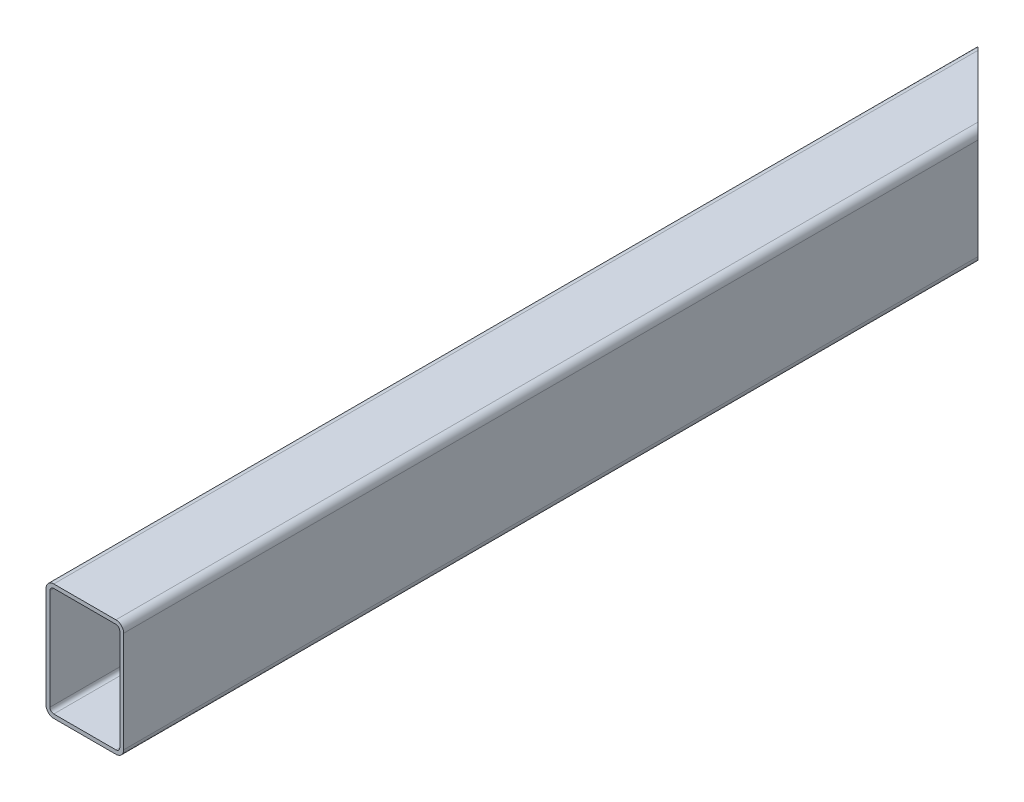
ISO-10303-21;
HEADER;
FILE_DESCRIPTION(('STEP AP214'),'2;1');
FILE_NAME('part.step','',(''),(''),'','','');
FILE_SCHEMA(('AUTOMOTIVE_DESIGN { 1 0 10303 214 1 1 1 1 }'));
ENDSEC;
DATA;
#1=APPLICATION_CONTEXT('core data for automotive mechanical design processes');
#2=APPLICATION_PROTOCOL_DEFINITION('international standard','automotive_design',2000,#1);
#3=PRODUCT_CONTEXT('',#1,'mechanical');
#4=PRODUCT('Part','Part','',(#3));
#5=PRODUCT_RELATED_PRODUCT_CATEGORY('part','',(#4));
#6=PRODUCT_DEFINITION_FORMATION('','',#4);
#7=PRODUCT_DEFINITION_CONTEXT('part definition',#1,'design');
#8=PRODUCT_DEFINITION('design','',#6,#7);
#9=PRODUCT_DEFINITION_SHAPE('','',#8);
#10=(LENGTH_UNIT() NAMED_UNIT(*) SI_UNIT(.MILLI.,.METRE.));
#11=(NAMED_UNIT(*) PLANE_ANGLE_UNIT() SI_UNIT($,.RADIAN.));
#12=(NAMED_UNIT(*) SI_UNIT($,.STERADIAN.) SOLID_ANGLE_UNIT());
#13=UNCERTAINTY_MEASURE_WITH_UNIT(LENGTH_MEASURE(1.E-05),#10,'distance_accuracy_value','');
#14=(GEOMETRIC_REPRESENTATION_CONTEXT(3) GLOBAL_UNCERTAINTY_ASSIGNED_CONTEXT((#13)) GLOBAL_UNIT_ASSIGNED_CONTEXT((#10,
#11,#12)) REPRESENTATION_CONTEXT('',''));
#15=CARTESIAN_POINT('',(0.,0.,0.));
#16=DIRECTION('',(0.,0.,1.));
#17=DIRECTION('',(1.,0.,0.));
#18=AXIS2_PLACEMENT_3D('',#15,#16,#17);
#19=CARTESIAN_POINT('',(-16.0000000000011,26.0000000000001,240.));
#20=DIRECTION('',(0.,0.,1.));
#21=DIRECTION('',(1.,0.,0.));
#22=AXIS2_PLACEMENT_3D('',#19,#20,#21);
#23=PLANE('',#22);
#24=CARTESIAN_POINT('',(-16.0000000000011,26.0000000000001,240.));
#25=DIRECTION('',(0.,0.,1.));
#26=DIRECTION('',(1.,0.,0.));
#27=AXIS2_PLACEMENT_3D('',#24,#25,#26);
#28=CIRCLE('',#27,4.);
#29=CARTESIAN_POINT('',(-16.0000000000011,30.0000000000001,240.));
#30=VERTEX_POINT('',#29);
#31=CARTESIAN_POINT('',(-20.0000000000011,26.0000000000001,240.));
#32=VERTEX_POINT('',#31);
#33=EDGE_CURVE('E190',#30,#32,#28,.T.);
#34=ORIENTED_EDGE('',*,*,#33,.T.);
#35=DIRECTION('',(0.,-1.,0.));
#36=VECTOR('',#35,1.);
#37=CARTESIAN_POINT('',(-20.0000000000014,-25.9999999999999,240.));
#38=LINE('',#37,#36);
#39=CARTESIAN_POINT('',(-20.0000000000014,-25.9999999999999,240.));
#40=VERTEX_POINT('',#39);
#41=EDGE_CURVE('E186',#32,#40,#38,.T.);
#42=ORIENTED_EDGE('',*,*,#41,.T.);
#43=CARTESIAN_POINT('',(-16.0000000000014,-25.9999999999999,240.));
#44=DIRECTION('',(0.,0.,1.));
#45=DIRECTION('',(1.,0.,0.));
#46=AXIS2_PLACEMENT_3D('',#43,#44,#45);
#47=CIRCLE('',#46,4.);
#48=CARTESIAN_POINT('',(-16.0000000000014,-29.9999999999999,240.));
#49=VERTEX_POINT('',#48);
#50=EDGE_CURVE('E241',#40,#49,#47,.T.);
#51=ORIENTED_EDGE('',*,*,#50,.T.);
#52=DIRECTION('',(1.,0.,0.));
#53=VECTOR('',#52,1.);
#54=CARTESIAN_POINT('',(-16.0000000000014,-29.9999999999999,240.));
#55=LINE('',#54,#53);
#56=CARTESIAN_POINT('',(15.9999999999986,-30.,240.));
#57=VERTEX_POINT('',#56);
#58=EDGE_CURVE('E243',#49,#57,#55,.T.);
#59=ORIENTED_EDGE('',*,*,#58,.T.);
#60=CARTESIAN_POINT('',(15.9999999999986,-26.,240.));
#61=DIRECTION('',(0.,0.,1.));
#62=DIRECTION('',(-1.,0.,0.));
#63=AXIS2_PLACEMENT_3D('',#60,#61,#62);
#64=CIRCLE('',#63,4.);
#65=CARTESIAN_POINT('',(19.9999999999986,-26.,240.));
#66=VERTEX_POINT('',#65);
#67=EDGE_CURVE('E245',#57,#66,#64,.T.);
#68=ORIENTED_EDGE('',*,*,#67,.T.);
#69=DIRECTION('',(0.,1.,0.));
#70=VECTOR('',#69,1.);
#71=CARTESIAN_POINT('',(19.9999999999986,-26.,240.));
#72=LINE('',#71,#70);
#73=CARTESIAN_POINT('',(19.9999999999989,26.,240.));
#74=VERTEX_POINT('',#73);
#75=EDGE_CURVE('E247',#66,#74,#72,.T.);
#76=ORIENTED_EDGE('',*,*,#75,.T.);
#77=CARTESIAN_POINT('',(15.9999999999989,26.,240.));
#78=DIRECTION('',(0.,0.,1.));
#79=DIRECTION('',(1.,0.,0.));
#80=AXIS2_PLACEMENT_3D('',#77,#78,#79);
#81=CIRCLE('',#80,4.);
#82=CARTESIAN_POINT('',(15.9999999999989,30.,240.));
#83=VERTEX_POINT('',#82);
#84=EDGE_CURVE('E249',#74,#83,#81,.T.);
#85=ORIENTED_EDGE('',*,*,#84,.T.);
#86=DIRECTION('',(-1.,0.,0.));
#87=VECTOR('',#86,1.);
#88=CARTESIAN_POINT('',(-16.0000000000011,30.0000000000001,240.));
#89=LINE('',#88,#87);
#90=EDGE_CURVE('E161',#83,#30,#89,.T.);
#91=ORIENTED_EDGE('',*,*,#90,.T.);
#92=EDGE_LOOP('',(#34,#42,#51,#59,#68,#76,#85,#91));
#93=FACE_BOUND('',#92,.T.);
#94=DIRECTION('',(0.,-1.,0.));
#95=VECTOR('',#94,1.);
#96=CARTESIAN_POINT('',(-18.0000000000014,-25.9999999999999,240.));
#97=LINE('',#96,#95);
#98=CARTESIAN_POINT('',(-18.0000000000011,26.0000000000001,240.));
#99=VERTEX_POINT('',#98);
#100=CARTESIAN_POINT('',(-18.0000000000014,-25.9999999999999,240.));
#101=VERTEX_POINT('',#100);
#102=EDGE_CURVE('E194',#99,#101,#97,.T.);
#103=ORIENTED_EDGE('',*,*,#102,.F.);
#104=CARTESIAN_POINT('',(-16.0000000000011,26.0000000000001,240.));
#105=DIRECTION('',(0.,0.,1.));
#106=DIRECTION('',(1.,0.,0.));
#107=AXIS2_PLACEMENT_3D('',#104,#105,#106);
#108=CIRCLE('',#107,2.);
#109=CARTESIAN_POINT('',(-16.0000000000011,28.0000000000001,240.));
#110=VERTEX_POINT('',#109);
#111=EDGE_CURVE('E191',#110,#99,#108,.T.);
#112=ORIENTED_EDGE('',*,*,#111,.F.);
#113=DIRECTION('',(-1.,0.,0.));
#114=VECTOR('',#113,1.);
#115=CARTESIAN_POINT('',(-16.0000000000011,28.0000000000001,240.));
#116=LINE('',#115,#114);
#117=CARTESIAN_POINT('',(15.9999999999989,28.,240.));
#118=VERTEX_POINT('',#117);
#119=EDGE_CURVE('E212',#118,#110,#116,.T.);
#120=ORIENTED_EDGE('',*,*,#119,.F.);
#121=CARTESIAN_POINT('',(15.9999999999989,26.,240.));
#122=DIRECTION('',(0.,0.,1.));
#123=DIRECTION('',(1.,0.,0.));
#124=AXIS2_PLACEMENT_3D('',#121,#122,#123);
#125=CIRCLE('',#124,2.);
#126=CARTESIAN_POINT('',(17.9999999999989,26.,240.));
#127=VERTEX_POINT('',#126);
#128=EDGE_CURVE('E209',#127,#118,#125,.T.);
#129=ORIENTED_EDGE('',*,*,#128,.F.);
#130=DIRECTION('',(0.,1.,0.));
#131=VECTOR('',#130,1.);
#132=CARTESIAN_POINT('',(17.9999999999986,-26.,240.));
#133=LINE('',#132,#131);
#134=CARTESIAN_POINT('',(17.9999999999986,-26.,240.));
#135=VERTEX_POINT('',#134);
#136=EDGE_CURVE('E207',#135,#127,#133,.T.);
#137=ORIENTED_EDGE('',*,*,#136,.F.);
#138=CARTESIAN_POINT('',(15.9999999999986,-26.,240.));
#139=DIRECTION('',(0.,0.,1.));
#140=DIRECTION('',(1.,0.,0.));
#141=AXIS2_PLACEMENT_3D('',#138,#139,#140);
#142=CIRCLE('',#141,2.);
#143=CARTESIAN_POINT('',(15.9999999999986,-28.0000000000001,240.));
#144=VERTEX_POINT('',#143);
#145=EDGE_CURVE('E205',#144,#135,#142,.T.);
#146=ORIENTED_EDGE('',*,*,#145,.F.);
#147=DIRECTION('',(1.,0.,0.));
#148=VECTOR('',#147,1.);
#149=CARTESIAN_POINT('',(-16.0000000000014,-27.9999999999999,240.));
#150=LINE('',#149,#148);
#151=CARTESIAN_POINT('',(-16.0000000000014,-27.9999999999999,240.));
#152=VERTEX_POINT('',#151);
#153=EDGE_CURVE('E203',#152,#144,#150,.T.);
#154=ORIENTED_EDGE('',*,*,#153,.F.);
#155=CARTESIAN_POINT('',(-16.0000000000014,-25.9999999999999,240.));
#156=DIRECTION('',(0.,0.,1.));
#157=DIRECTION('',(1.,0.,0.));
#158=AXIS2_PLACEMENT_3D('',#155,#156,#157);
#159=CIRCLE('',#158,2.);
#160=EDGE_CURVE('E201',#101,#152,#159,.T.);
#161=ORIENTED_EDGE('',*,*,#160,.F.);
#162=EDGE_LOOP('',(#103,#112,#120,#129,#137,#146,#154,#161));
#163=FACE_BOUND('',#162,.T.);
#164=ADVANCED_FACE('F28',(#93,#163),#23,.T.);
#165=CARTESIAN_POINT('',(-16.0000000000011,26.0000000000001,240.));
#166=DIRECTION('',(0.,0.,-1.));
#167=DIRECTION('',(-1.,0.,0.));
#168=AXIS2_PLACEMENT_3D('',#165,#166,#167);
#169=CYLINDRICAL_SURFACE('',#168,4.);
#170=DIRECTION('',(0.,0.,-1.));
#171=VECTOR('',#170,1.);
#172=CARTESIAN_POINT('',(-16.0000000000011,30.0000000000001,240.));
#173=LINE('',#172,#171);
#174=CARTESIAN_POINT('',(-15.9999999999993,30.0000000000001,-236.));
#175=VERTEX_POINT('',#174);
#176=EDGE_CURVE('E162',#30,#175,#173,.T.);
#177=ORIENTED_EDGE('',*,*,#176,.T.);
#178=CARTESIAN_POINT('',(-15.9999999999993,26.0000000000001,-236.));
#179=DIRECTION('',(-0.707106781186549,0.,0.707106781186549));
#180=DIRECTION('',(-0.707106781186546,0.,-0.707106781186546));
#181=AXIS2_PLACEMENT_3D('',#178,#179,#180);
#182=ELLIPSE('',#181,5.65685424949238,4.);
#183=CARTESIAN_POINT('',(-19.9999999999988,26.0000000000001,-240.));
#184=VERTEX_POINT('',#183);
#185=EDGE_CURVE('E43',#175,#184,#182,.T.);
#186=ORIENTED_EDGE('',*,*,#185,.T.);
#187=DIRECTION('',(0.,0.,-1.));
#188=VECTOR('',#187,1.);
#189=CARTESIAN_POINT('',(-20.0000000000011,26.0000000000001,240.));
#190=LINE('',#189,#188);
#191=EDGE_CURVE('E36',#32,#184,#190,.T.);
#192=ORIENTED_EDGE('',*,*,#191,.F.);
#193=ORIENTED_EDGE('',*,*,#33,.F.);
#194=EDGE_LOOP('',(#177,#186,#192,#193));
#195=FACE_BOUND('',#194,.T.);
#196=ADVANCED_FACE('F30',(#195),#169,.T.);
#197=CARTESIAN_POINT('',(-20.0000000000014,-25.9999999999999,240.));
#198=DIRECTION('',(1.,0.,0.));
#199=DIRECTION('',(0.,0.,-1.));
#200=AXIS2_PLACEMENT_3D('',#197,#198,#199);
#201=PLANE('',#200);
#202=DIRECTION('',(0.,-1.,0.));
#203=VECTOR('',#202,1.);
#204=CARTESIAN_POINT('',(-19.9999999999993,-25.9999999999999,-240.));
#205=LINE('',#204,#203);
#206=CARTESIAN_POINT('',(-19.9999999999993,-25.9999999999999,-240.));
#207=VERTEX_POINT('',#206);
#208=EDGE_CURVE('E185',#184,#207,#205,.T.);
#209=ORIENTED_EDGE('',*,*,#208,.T.);
#210=DIRECTION('',(0.,0.,-1.));
#211=VECTOR('',#210,1.);
#212=CARTESIAN_POINT('',(-20.0000000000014,-25.9999999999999,240.));
#213=LINE('',#212,#211);
#214=EDGE_CURVE('E177',#40,#207,#213,.T.);
#215=ORIENTED_EDGE('',*,*,#214,.F.);
#216=ORIENTED_EDGE('',*,*,#41,.F.);
#217=ORIENTED_EDGE('',*,*,#191,.T.);
#218=EDGE_LOOP('',(#209,#215,#216,#217));
#219=FACE_BOUND('',#218,.T.);
#220=ADVANCED_FACE('F183',(#219),#201,.F.);
#221=CARTESIAN_POINT('',(-16.0000000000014,-25.9999999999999,240.));
#222=DIRECTION('',(0.,0.,-1.));
#223=DIRECTION('',(-1.,0.,0.));
#224=AXIS2_PLACEMENT_3D('',#221,#222,#223);
#225=CYLINDRICAL_SURFACE('',#224,4.);
#226=ORIENTED_EDGE('',*,*,#214,.T.);
#227=CARTESIAN_POINT('',(-15.9999999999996,-25.9999999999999,-236.));
#228=DIRECTION('',(-0.707106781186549,0.,0.707106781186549));
#229=DIRECTION('',(-0.707106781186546,0.,-0.707106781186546));
#230=AXIS2_PLACEMENT_3D('',#227,#228,#229);
#231=ELLIPSE('',#230,5.65685424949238,4.);
#232=CARTESIAN_POINT('',(-15.9999999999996,-29.9999999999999,-236.));
#233=VERTEX_POINT('',#232);
#234=EDGE_CURVE('E192',#207,#233,#231,.T.);
#235=ORIENTED_EDGE('',*,*,#234,.T.);
#236=DIRECTION('',(0.,0.,-1.));
#237=VECTOR('',#236,1.);
#238=CARTESIAN_POINT('',(-16.0000000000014,-29.9999999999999,240.));
#239=LINE('',#238,#237);
#240=EDGE_CURVE('E174',#49,#233,#239,.T.);
#241=ORIENTED_EDGE('',*,*,#240,.F.);
#242=ORIENTED_EDGE('',*,*,#50,.F.);
#243=EDGE_LOOP('',(#226,#235,#241,#242));
#244=FACE_BOUND('',#243,.T.);
#245=ADVANCED_FACE('F283',(#244),#225,.T.);
#246=CARTESIAN_POINT('',(-16.0000000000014,-29.9999999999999,240.));
#247=DIRECTION('',(0.,1.,0.));
#248=DIRECTION('',(-1.,0.,0.));
#249=AXIS2_PLACEMENT_3D('',#246,#247,#248);
#250=PLANE('',#249);
#251=ORIENTED_EDGE('',*,*,#240,.T.);
#252=DIRECTION('',(0.707106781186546,0.,0.707106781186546));
#253=VECTOR('',#252,1.);
#254=CARTESIAN_POINT('',(-19.9999999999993,-29.9999999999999,-240.));
#255=LINE('',#254,#253);
#256=CARTESIAN_POINT('',(16.0000000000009,-30.,-204.));
#257=VERTEX_POINT('',#256);
#258=EDGE_CURVE('E146',#233,#257,#255,.T.);
#259=ORIENTED_EDGE('',*,*,#258,.T.);
#260=DIRECTION('',(0.,0.,-1.));
#261=VECTOR('',#260,1.);
#262=CARTESIAN_POINT('',(15.9999999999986,-30.,240.));
#263=LINE('',#262,#261);
#264=EDGE_CURVE('E171',#57,#257,#263,.T.);
#265=ORIENTED_EDGE('',*,*,#264,.F.);
#266=ORIENTED_EDGE('',*,*,#58,.F.);
#267=EDGE_LOOP('',(#251,#259,#265,#266));
#268=FACE_BOUND('',#267,.T.);
#269=ADVANCED_FACE('F278',(#268),#250,.F.);
#270=CARTESIAN_POINT('',(15.9999999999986,-26.,240.));
#271=DIRECTION('',(0.,0.,-1.));
#272=DIRECTION('',(-1.,0.,0.));
#273=AXIS2_PLACEMENT_3D('',#270,#271,#272);
#274=CYLINDRICAL_SURFACE('',#273,4.);
#275=ORIENTED_EDGE('',*,*,#264,.T.);
#276=CARTESIAN_POINT('',(16.0000000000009,-26.,-204.));
#277=DIRECTION('',(-0.707106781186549,0.,0.707106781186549));
#278=DIRECTION('',(-0.707106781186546,0.,-0.707106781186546));
#279=AXIS2_PLACEMENT_3D('',#276,#277,#278);
#280=ELLIPSE('',#279,5.65685424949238,4.);
#281=CARTESIAN_POINT('',(20.0000000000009,-26.,-200.));
#282=VERTEX_POINT('',#281);
#283=EDGE_CURVE('E157',#257,#282,#280,.T.);
#284=ORIENTED_EDGE('',*,*,#283,.T.);
#285=DIRECTION('',(0.,0.,-1.));
#286=VECTOR('',#285,1.);
#287=CARTESIAN_POINT('',(19.9999999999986,-26.,240.));
#288=LINE('',#287,#286);
#289=EDGE_CURVE('E164',#66,#282,#288,.T.);
#290=ORIENTED_EDGE('',*,*,#289,.F.);
#291=ORIENTED_EDGE('',*,*,#67,.F.);
#292=EDGE_LOOP('',(#275,#284,#290,#291));
#293=FACE_BOUND('',#292,.T.);
#294=ADVANCED_FACE('F275',(#293),#274,.T.);
#295=CARTESIAN_POINT('',(19.9999999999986,-26.,240.));
#296=DIRECTION('',(-1.,0.,0.));
#297=DIRECTION('',(0.,0.,1.));
#298=AXIS2_PLACEMENT_3D('',#295,#296,#297);
#299=PLANE('',#298);
#300=ORIENTED_EDGE('',*,*,#289,.T.);
#301=DIRECTION('',(0.,1.,0.));
#302=VECTOR('',#301,1.);
#303=CARTESIAN_POINT('',(20.0000000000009,-30.,-200.));
#304=LINE('',#303,#302);
#305=CARTESIAN_POINT('',(20.0000000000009,26.,-200.));
#306=VERTEX_POINT('',#305);
#307=EDGE_CURVE('E257',#282,#306,#304,.T.);
#308=ORIENTED_EDGE('',*,*,#307,.T.);
#309=DIRECTION('',(0.,0.,-1.));
#310=VECTOR('',#309,1.);
#311=CARTESIAN_POINT('',(19.9999999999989,26.,240.));
#312=LINE('',#311,#310);
#313=EDGE_CURVE('E156',#74,#306,#312,.T.);
#314=ORIENTED_EDGE('',*,*,#313,.F.);
#315=ORIENTED_EDGE('',*,*,#75,.F.);
#316=EDGE_LOOP('',(#300,#308,#314,#315));
#317=FACE_BOUND('',#316,.T.);
#318=ADVANCED_FACE('F256',(#317),#299,.F.);
#319=CARTESIAN_POINT('',(15.9999999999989,26.,240.));
#320=DIRECTION('',(0.,0.,-1.));
#321=DIRECTION('',(-1.,0.,0.));
#322=AXIS2_PLACEMENT_3D('',#319,#320,#321);
#323=CYLINDRICAL_SURFACE('',#322,4.);
#324=ORIENTED_EDGE('',*,*,#313,.T.);
#325=CARTESIAN_POINT('',(16.0000000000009,26.,-204.));
#326=DIRECTION('',(-0.707106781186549,0.,0.707106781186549));
#327=DIRECTION('',(-0.707106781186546,0.,-0.707106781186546));
#328=AXIS2_PLACEMENT_3D('',#325,#326,#327);
#329=ELLIPSE('',#328,5.65685424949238,4.);
#330=CARTESIAN_POINT('',(16.0000000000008,30.,-204.));
#331=VERTEX_POINT('',#330);
#332=EDGE_CURVE('E140',#306,#331,#329,.T.);
#333=ORIENTED_EDGE('',*,*,#332,.T.);
#334=DIRECTION('',(0.,0.,-1.));
#335=VECTOR('',#334,1.);
#336=CARTESIAN_POINT('',(15.9999999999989,30.,240.));
#337=LINE('',#336,#335);
#338=EDGE_CURVE('E153',#83,#331,#337,.T.);
#339=ORIENTED_EDGE('',*,*,#338,.F.);
#340=ORIENTED_EDGE('',*,*,#84,.F.);
#341=EDGE_LOOP('',(#324,#333,#339,#340));
#342=FACE_BOUND('',#341,.T.);
#343=ADVANCED_FACE('F151',(#342),#323,.T.);
#344=CARTESIAN_POINT('',(-16.0000000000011,30.0000000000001,240.));
#345=DIRECTION('',(0.,-1.,0.));
#346=DIRECTION('',(1.,0.,0.));
#347=AXIS2_PLACEMENT_3D('',#344,#345,#346);
#348=PLANE('',#347);
#349=ORIENTED_EDGE('',*,*,#338,.T.);
#350=DIRECTION('',(0.707106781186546,0.,0.707106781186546));
#351=VECTOR('',#350,1.);
#352=CARTESIAN_POINT('',(-19.9999999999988,30.0000000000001,-240.));
#353=LINE('',#352,#351);
#354=EDGE_CURVE('E137',#175,#331,#353,.T.);
#355=ORIENTED_EDGE('',*,*,#354,.F.);
#356=ORIENTED_EDGE('',*,*,#176,.F.);
#357=ORIENTED_EDGE('',*,*,#90,.F.);
#358=EDGE_LOOP('',(#349,#355,#356,#357));
#359=FACE_BOUND('',#358,.T.);
#360=ADVANCED_FACE('F160',(#359),#348,.F.);
#361=CARTESIAN_POINT('',(-16.0000000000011,26.0000000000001,240.));
#362=DIRECTION('',(0.,0.,-1.));
#363=DIRECTION('',(-1.,0.,0.));
#364=AXIS2_PLACEMENT_3D('',#361,#362,#363);
#365=CYLINDRICAL_SURFACE('',#364,2.);
#366=CARTESIAN_POINT('',(-15.9999999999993,26.0000000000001,-236.));
#367=DIRECTION('',(-0.707106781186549,0.,0.707106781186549));
#368=DIRECTION('',(-0.707106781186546,0.,-0.707106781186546));
#369=AXIS2_PLACEMENT_3D('',#366,#367,#368);
#370=ELLIPSE('',#369,2.82842712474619,2.);
#371=CARTESIAN_POINT('',(-15.9999999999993,28.0000000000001,-236.));
#372=VERTEX_POINT('',#371);
#373=CARTESIAN_POINT('',(-17.9999999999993,26.0000000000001,-238.));
#374=VERTEX_POINT('',#373);
#375=EDGE_CURVE('E158',#372,#374,#370,.T.);
#376=ORIENTED_EDGE('',*,*,#375,.F.);
#377=DIRECTION('',(0.,0.,-1.));
#378=VECTOR('',#377,1.);
#379=CARTESIAN_POINT('',(-16.0000000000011,28.0000000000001,240.));
#380=LINE('',#379,#378);
#381=EDGE_CURVE('E214',#110,#372,#380,.T.);
#382=ORIENTED_EDGE('',*,*,#381,.F.);
#383=ORIENTED_EDGE('',*,*,#111,.T.);
#384=DIRECTION('',(0.,0.,-1.));
#385=VECTOR('',#384,1.);
#386=CARTESIAN_POINT('',(-18.0000000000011,26.0000000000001,240.));
#387=LINE('',#386,#385);
#388=EDGE_CURVE('E235',#99,#374,#387,.T.);
#389=ORIENTED_EDGE('',*,*,#388,.T.);
#390=EDGE_LOOP('',(#376,#382,#383,#389));
#391=FACE_BOUND('',#390,.T.);
#392=ADVANCED_FACE('F298',(#391),#365,.F.);
#393=CARTESIAN_POINT('',(-18.0000000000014,-25.9999999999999,240.));
#394=DIRECTION('',(1.,0.,0.));
#395=DIRECTION('',(0.,0.,-1.));
#396=AXIS2_PLACEMENT_3D('',#393,#394,#395);
#397=PLANE('',#396);
#398=DIRECTION('',(0.,-1.,0.));
#399=VECTOR('',#398,1.);
#400=CARTESIAN_POINT('',(-17.9999999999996,-25.9999999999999,-238.));
#401=LINE('',#400,#399);
#402=CARTESIAN_POINT('',(-17.9999999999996,-25.9999999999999,-238.));
#403=VERTEX_POINT('',#402);
#404=EDGE_CURVE('E272',#374,#403,#401,.T.);
#405=ORIENTED_EDGE('',*,*,#404,.F.);
#406=ORIENTED_EDGE('',*,*,#388,.F.);
#407=ORIENTED_EDGE('',*,*,#102,.T.);
#408=DIRECTION('',(0.,0.,-1.));
#409=VECTOR('',#408,1.);
#410=CARTESIAN_POINT('',(-18.0000000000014,-25.9999999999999,240.));
#411=LINE('',#410,#409);
#412=EDGE_CURVE('E232',#101,#403,#411,.T.);
#413=ORIENTED_EDGE('',*,*,#412,.T.);
#414=EDGE_LOOP('',(#405,#406,#407,#413));
#415=FACE_BOUND('',#414,.T.);
#416=ADVANCED_FACE('F329',(#415),#397,.T.);
#417=CARTESIAN_POINT('',(-16.0000000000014,-25.9999999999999,240.));
#418=DIRECTION('',(0.,0.,-1.));
#419=DIRECTION('',(-1.,0.,0.));
#420=AXIS2_PLACEMENT_3D('',#417,#418,#419);
#421=CYLINDRICAL_SURFACE('',#420,2.);
#422=CARTESIAN_POINT('',(-15.9999999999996,-25.9999999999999,-236.));
#423=DIRECTION('',(-0.707106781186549,0.,0.707106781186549));
#424=DIRECTION('',(-0.707106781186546,0.,-0.707106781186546));
#425=AXIS2_PLACEMENT_3D('',#422,#423,#424);
#426=ELLIPSE('',#425,2.82842712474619,2.);
#427=CARTESIAN_POINT('',(-15.9999999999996,-27.9999999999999,-236.));
#428=VERTEX_POINT('',#427);
#429=EDGE_CURVE('E270',#403,#428,#426,.T.);
#430=ORIENTED_EDGE('',*,*,#429,.F.);
#431=ORIENTED_EDGE('',*,*,#412,.F.);
#432=ORIENTED_EDGE('',*,*,#160,.T.);
#433=DIRECTION('',(0.,0.,-1.));
#434=VECTOR('',#433,1.);
#435=CARTESIAN_POINT('',(-16.0000000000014,-27.9999999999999,240.));
#436=LINE('',#435,#434);
#437=EDGE_CURVE('E229',#152,#428,#436,.T.);
#438=ORIENTED_EDGE('',*,*,#437,.T.);
#439=EDGE_LOOP('',(#430,#431,#432,#438));
#440=FACE_BOUND('',#439,.T.);
#441=ADVANCED_FACE('F336',(#440),#421,.F.);
#442=CARTESIAN_POINT('',(-16.0000000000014,-27.9999999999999,240.));
#443=DIRECTION('',(0.,1.,0.));
#444=DIRECTION('',(-1.,0.,0.));
#445=AXIS2_PLACEMENT_3D('',#442,#443,#444);
#446=PLANE('',#445);
#447=DIRECTION('',(0.707106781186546,0.,0.707106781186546));
#448=VECTOR('',#447,1.);
#449=CARTESIAN_POINT('',(222.,-28.0000000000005,1.99999999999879));
#450=LINE('',#449,#448);
#451=CARTESIAN_POINT('',(16.0000000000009,-28.0000000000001,-204.));
#452=VERTEX_POINT('',#451);
#453=EDGE_CURVE('E268',#428,#452,#450,.T.);
#454=ORIENTED_EDGE('',*,*,#453,.F.);
#455=ORIENTED_EDGE('',*,*,#437,.F.);
#456=ORIENTED_EDGE('',*,*,#153,.T.);
#457=DIRECTION('',(0.,0.,-1.));
#458=VECTOR('',#457,1.);
#459=CARTESIAN_POINT('',(15.9999999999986,-28.0000000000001,240.));
#460=LINE('',#459,#458);
#461=EDGE_CURVE('E226',#144,#452,#460,.T.);
#462=ORIENTED_EDGE('',*,*,#461,.T.);
#463=EDGE_LOOP('',(#454,#455,#456,#462));
#464=FACE_BOUND('',#463,.T.);
#465=ADVANCED_FACE('F343',(#464),#446,.T.);
#466=CARTESIAN_POINT('',(15.9999999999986,-26.,240.));
#467=DIRECTION('',(0.,0.,-1.));
#468=DIRECTION('',(-1.,0.,0.));
#469=AXIS2_PLACEMENT_3D('',#466,#467,#468);
#470=CYLINDRICAL_SURFACE('',#469,2.);
#471=CARTESIAN_POINT('',(16.0000000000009,-26.,-204.));
#472=DIRECTION('',(-0.707106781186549,0.,0.707106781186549));
#473=DIRECTION('',(-0.707106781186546,0.,-0.707106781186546));
#474=AXIS2_PLACEMENT_3D('',#471,#472,#473);
#475=ELLIPSE('',#474,2.82842712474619,2.);
#476=CARTESIAN_POINT('',(18.0000000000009,-26.,-202.));
#477=VERTEX_POINT('',#476);
#478=EDGE_CURVE('E266',#452,#477,#475,.T.);
#479=ORIENTED_EDGE('',*,*,#478,.F.);
#480=ORIENTED_EDGE('',*,*,#461,.F.);
#481=ORIENTED_EDGE('',*,*,#145,.T.);
#482=DIRECTION('',(0.,0.,-1.));
#483=VECTOR('',#482,1.);
#484=CARTESIAN_POINT('',(17.9999999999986,-26.,240.));
#485=LINE('',#484,#483);
#486=EDGE_CURVE('E223',#135,#477,#485,.T.);
#487=ORIENTED_EDGE('',*,*,#486,.T.);
#488=EDGE_LOOP('',(#479,#480,#481,#487));
#489=FACE_BOUND('',#488,.T.);
#490=ADVANCED_FACE('F351',(#489),#470,.F.);
#491=CARTESIAN_POINT('',(17.9999999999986,-26.,240.));
#492=DIRECTION('',(-1.,0.,0.));
#493=DIRECTION('',(0.,0.,1.));
#494=AXIS2_PLACEMENT_3D('',#491,#492,#493);
#495=PLANE('',#494);
#496=DIRECTION('',(0.,1.,0.));
#497=VECTOR('',#496,1.);
#498=CARTESIAN_POINT('',(18.0000000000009,-26.,-202.));
#499=LINE('',#498,#497);
#500=CARTESIAN_POINT('',(18.0000000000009,26.,-202.));
#501=VERTEX_POINT('',#500);
#502=EDGE_CURVE('E260',#477,#501,#499,.T.);
#503=ORIENTED_EDGE('',*,*,#502,.F.);
#504=ORIENTED_EDGE('',*,*,#486,.F.);
#505=ORIENTED_EDGE('',*,*,#136,.T.);
#506=DIRECTION('',(0.,0.,-1.));
#507=VECTOR('',#506,1.);
#508=CARTESIAN_POINT('',(17.9999999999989,26.,240.));
#509=LINE('',#508,#507);
#510=EDGE_CURVE('E220',#127,#501,#509,.T.);
#511=ORIENTED_EDGE('',*,*,#510,.T.);
#512=EDGE_LOOP('',(#503,#504,#505,#511));
#513=FACE_BOUND('',#512,.T.);
#514=ADVANCED_FACE('F359',(#513),#495,.T.);
#515=CARTESIAN_POINT('',(15.9999999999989,26.,240.));
#516=DIRECTION('',(0.,0.,-1.));
#517=DIRECTION('',(-1.,0.,0.));
#518=AXIS2_PLACEMENT_3D('',#515,#516,#517);
#519=CYLINDRICAL_SURFACE('',#518,2.);
#520=CARTESIAN_POINT('',(16.0000000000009,26.,-204.));
#521=DIRECTION('',(-0.707106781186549,0.,0.707106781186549));
#522=DIRECTION('',(-0.707106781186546,0.,-0.707106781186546));
#523=AXIS2_PLACEMENT_3D('',#520,#521,#522);
#524=ELLIPSE('',#523,2.82842712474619,2.);
#525=CARTESIAN_POINT('',(16.0000000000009,28.,-204.));
#526=VERTEX_POINT('',#525);
#527=EDGE_CURVE('E50',#501,#526,#524,.T.);
#528=ORIENTED_EDGE('',*,*,#527,.F.);
#529=ORIENTED_EDGE('',*,*,#510,.F.);
#530=ORIENTED_EDGE('',*,*,#128,.T.);
#531=DIRECTION('',(0.,0.,-1.));
#532=VECTOR('',#531,1.);
#533=CARTESIAN_POINT('',(15.9999999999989,28.,240.));
#534=LINE('',#533,#532);
#535=EDGE_CURVE('E217',#118,#526,#534,.T.);
#536=ORIENTED_EDGE('',*,*,#535,.T.);
#537=EDGE_LOOP('',(#528,#529,#530,#536));
#538=FACE_BOUND('',#537,.T.);
#539=ADVANCED_FACE('F367',(#538),#519,.F.);
#540=CARTESIAN_POINT('',(-16.0000000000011,28.0000000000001,240.));
#541=DIRECTION('',(0.,-1.,0.));
#542=DIRECTION('',(1.,0.,0.));
#543=AXIS2_PLACEMENT_3D('',#540,#541,#542);
#544=PLANE('',#543);
#545=DIRECTION('',(-0.707106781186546,0.,-0.707106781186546));
#546=VECTOR('',#545,1.);
#547=CARTESIAN_POINT('',(222.,27.9999999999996,1.99999999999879));
#548=LINE('',#547,#546);
#549=EDGE_CURVE('E11',#526,#372,#548,.T.);
#550=ORIENTED_EDGE('',*,*,#549,.F.);
#551=ORIENTED_EDGE('',*,*,#535,.F.);
#552=ORIENTED_EDGE('',*,*,#119,.T.);
#553=ORIENTED_EDGE('',*,*,#381,.T.);
#554=EDGE_LOOP('',(#550,#551,#552,#553));
#555=FACE_BOUND('',#554,.T.);
#556=ADVANCED_FACE('F375',(#555),#544,.T.);
#557=CARTESIAN_POINT('',(-19.9999999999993,-29.9999999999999,-240.));
#558=DIRECTION('',(-0.707106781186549,0.,0.707106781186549));
#559=DIRECTION('',(0.707106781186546,0.,0.707106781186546));
#560=AXIS2_PLACEMENT_3D('',#557,#558,#559);
#561=PLANE('',#560);
#562=ORIENTED_EDGE('',*,*,#375,.T.);
#563=ORIENTED_EDGE('',*,*,#404,.T.);
#564=ORIENTED_EDGE('',*,*,#429,.T.);
#565=ORIENTED_EDGE('',*,*,#453,.T.);
#566=ORIENTED_EDGE('',*,*,#478,.T.);
#567=ORIENTED_EDGE('',*,*,#502,.T.);
#568=ORIENTED_EDGE('',*,*,#527,.T.);
#569=ORIENTED_EDGE('',*,*,#549,.T.);
#570=EDGE_LOOP('',(#562,#563,#564,#565,#566,#567,#568,#569));
#571=FACE_BOUND('',#570,.T.);
#572=ORIENTED_EDGE('',*,*,#354,.T.);
#573=ORIENTED_EDGE('',*,*,#332,.F.);
#574=ORIENTED_EDGE('',*,*,#307,.F.);
#575=ORIENTED_EDGE('',*,*,#283,.F.);
#576=ORIENTED_EDGE('',*,*,#258,.F.);
#577=ORIENTED_EDGE('',*,*,#234,.F.);
#578=ORIENTED_EDGE('',*,*,#208,.F.);
#579=ORIENTED_EDGE('',*,*,#185,.F.);
#580=EDGE_LOOP('',(#572,#573,#574,#575,#576,#577,#578,#579));
#581=FACE_BOUND('',#580,.T.);
#582=ADVANCED_FACE('F139',(#571,#581),#561,.F.);
#583=CLOSED_SHELL('',(#164,#196,#220,#245,#269,#294,#318,#343,#360,#392,#416,#441,#465,#490,
#514,#539,#556,#582));
#584=MANIFOLD_SOLID_BREP('B2',#583);
#585=ADVANCED_BREP_SHAPE_REPRESENTATION('',(#18,#584),#14);
#586=SHAPE_DEFINITION_REPRESENTATION(#9,#585);
ENDSEC;
END-ISO-10303-21;
